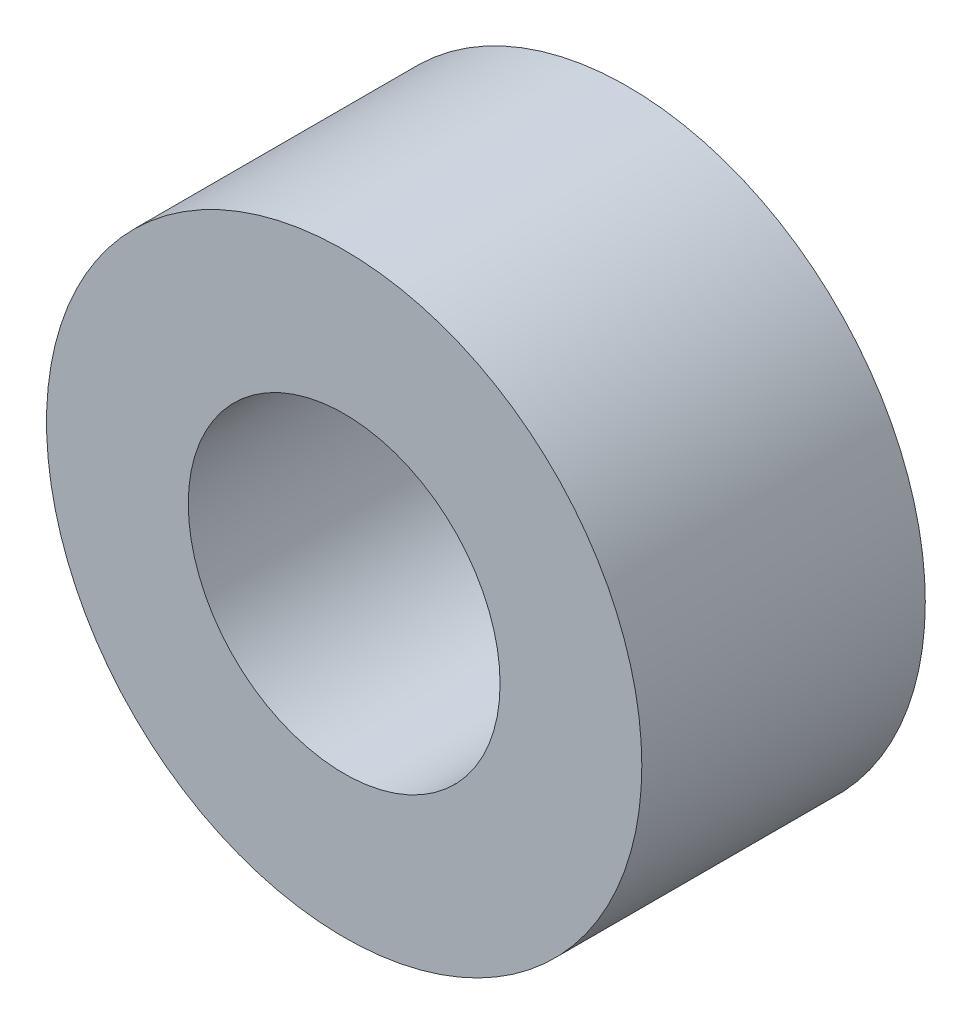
ISO-10303-21;
HEADER;
FILE_DESCRIPTION(('STEP AP214'),'2;1');
FILE_NAME('part.step','',(''),(''),'','','');
FILE_SCHEMA(('AUTOMOTIVE_DESIGN { 1 0 10303 214 1 1 1 1 }'));
ENDSEC;
DATA;
#1=APPLICATION_CONTEXT('core data for automotive mechanical design processes');
#2=APPLICATION_PROTOCOL_DEFINITION('international standard','automotive_design',2000,#1);
#3=PRODUCT_CONTEXT('',#1,'mechanical');
#4=PRODUCT('Part','Part','',(#3));
#5=PRODUCT_RELATED_PRODUCT_CATEGORY('part','',(#4));
#6=PRODUCT_DEFINITION_FORMATION('','',#4);
#7=PRODUCT_DEFINITION_CONTEXT('part definition',#1,'design');
#8=PRODUCT_DEFINITION('design','',#6,#7);
#9=PRODUCT_DEFINITION_SHAPE('','',#8);
#10=(LENGTH_UNIT() NAMED_UNIT(*) SI_UNIT(.MILLI.,.METRE.));
#11=(NAMED_UNIT(*) PLANE_ANGLE_UNIT() SI_UNIT($,.RADIAN.));
#12=(NAMED_UNIT(*) SI_UNIT($,.STERADIAN.) SOLID_ANGLE_UNIT());
#13=UNCERTAINTY_MEASURE_WITH_UNIT(LENGTH_MEASURE(1.E-05),#10,'distance_accuracy_value','');
#14=(GEOMETRIC_REPRESENTATION_CONTEXT(3) GLOBAL_UNCERTAINTY_ASSIGNED_CONTEXT((#13)) GLOBAL_UNIT_ASSIGNED_CONTEXT((#10,
#11,#12)) REPRESENTATION_CONTEXT('',''));
#15=CARTESIAN_POINT('',(0.,0.,0.));
#16=DIRECTION('',(0.,0.,1.));
#17=DIRECTION('',(1.,0.,0.));
#18=AXIS2_PLACEMENT_3D('',#15,#16,#17);
#19=CARTESIAN_POINT('',(0.,0.,-1.));
#20=DIRECTION('',(0.,0.,1.));
#21=DIRECTION('',(1.,0.,0.));
#22=AXIS2_PLACEMENT_3D('',#19,#20,#21);
#23=CYLINDRICAL_SURFACE('',#22,2.1);
#24=CARTESIAN_POINT('',(0.,0.,-1.));
#25=DIRECTION('',(0.,0.,1.));
#26=DIRECTION('',(1.,0.,0.));
#27=AXIS2_PLACEMENT_3D('',#24,#25,#26);
#28=CIRCLE('',#27,2.1);
#29=CARTESIAN_POINT('',(2.1,0.,-1.));
#30=VERTEX_POINT('',#29);
#31=EDGE_CURVE('E10',#30,#30,#28,.T.);
#32=ORIENTED_EDGE('',*,*,#31,.T.);
#33=EDGE_LOOP('',(#32));
#34=FACE_BOUND('',#33,.T.);
#35=CARTESIAN_POINT('',(0.,0.,1.));
#36=DIRECTION('',(0.,0.,1.));
#37=DIRECTION('',(1.,0.,0.));
#38=AXIS2_PLACEMENT_3D('',#35,#36,#37);
#39=CIRCLE('',#38,2.1);
#40=CARTESIAN_POINT('',(2.1,0.,1.));
#41=VERTEX_POINT('',#40);
#42=EDGE_CURVE('E49',#41,#41,#39,.T.);
#43=ORIENTED_EDGE('',*,*,#42,.F.);
#44=EDGE_LOOP('',(#43));
#45=FACE_BOUND('',#44,.T.);
#46=ADVANCED_FACE('F39',(#34,#45),#23,.T.);
#47=CARTESIAN_POINT('',(0.,0.,-1.));
#48=DIRECTION('',(0.,0.,1.));
#49=DIRECTION('',(1.,0.,0.));
#50=AXIS2_PLACEMENT_3D('',#47,#48,#49);
#51=PLANE('',#50);
#52=CARTESIAN_POINT('',(0.,0.,-1.));
#53=DIRECTION('',(0.,0.,1.));
#54=DIRECTION('',(1.,0.,0.));
#55=AXIS2_PLACEMENT_3D('',#52,#53,#54);
#56=CIRCLE('',#55,1.1);
#57=CARTESIAN_POINT('',(1.1,0.,-1.));
#58=VERTEX_POINT('',#57);
#59=EDGE_CURVE('E45',#58,#58,#56,.T.);
#60=ORIENTED_EDGE('',*,*,#59,.T.);
#61=EDGE_LOOP('',(#60));
#62=FACE_BOUND('',#61,.T.);
#63=ORIENTED_EDGE('',*,*,#31,.F.);
#64=EDGE_LOOP('',(#63));
#65=FACE_BOUND('',#64,.T.);
#66=ADVANCED_FACE('F68',(#62,#65),#51,.F.);
#67=CARTESIAN_POINT('',(0.,0.,-1.));
#68=DIRECTION('',(0.,0.,1.));
#69=DIRECTION('',(1.,0.,0.));
#70=AXIS2_PLACEMENT_3D('',#67,#68,#69);
#71=CYLINDRICAL_SURFACE('',#70,1.1);
#72=ORIENTED_EDGE('',*,*,#59,.F.);
#73=EDGE_LOOP('',(#72));
#74=FACE_BOUND('',#73,.T.);
#75=CARTESIAN_POINT('',(0.,0.,1.));
#76=DIRECTION('',(0.,0.,1.));
#77=DIRECTION('',(1.,0.,0.));
#78=AXIS2_PLACEMENT_3D('',#75,#76,#77);
#79=CIRCLE('',#78,1.1);
#80=CARTESIAN_POINT('',(1.1,0.,1.));
#81=VERTEX_POINT('',#80);
#82=EDGE_CURVE('E53',#81,#81,#79,.T.);
#83=ORIENTED_EDGE('',*,*,#82,.T.);
#84=EDGE_LOOP('',(#83));
#85=FACE_BOUND('',#84,.T.);
#86=ADVANCED_FACE('F59',(#74,#85),#71,.F.);
#87=CARTESIAN_POINT('',(0.,0.,1.));
#88=DIRECTION('',(0.,0.,1.));
#89=DIRECTION('',(1.,0.,0.));
#90=AXIS2_PLACEMENT_3D('',#87,#88,#89);
#91=PLANE('',#90);
#92=ORIENTED_EDGE('',*,*,#42,.T.);
#93=EDGE_LOOP('',(#92));
#94=FACE_BOUND('',#93,.T.);
#95=ORIENTED_EDGE('',*,*,#82,.F.);
#96=EDGE_LOOP('',(#95));
#97=FACE_BOUND('',#96,.T.);
#98=ADVANCED_FACE('F61',(#94,#97),#91,.T.);
#99=CLOSED_SHELL('',(#46,#66,#86,#98));
#100=MANIFOLD_SOLID_BREP('B2',#99);
#101=ADVANCED_BREP_SHAPE_REPRESENTATION('',(#18,#100),#14);
#102=SHAPE_DEFINITION_REPRESENTATION(#9,#101);
ENDSEC;
END-ISO-10303-21;
